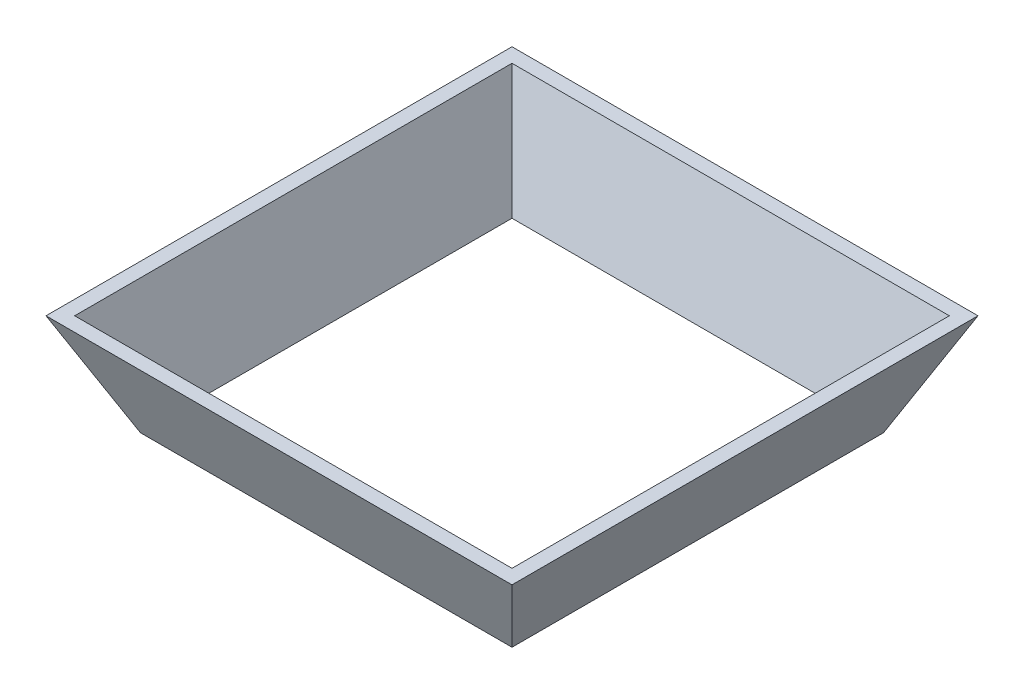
from build123d import *

# Parameters (mm, degrees)
SKETCH1_W           = 55
SKETCH1_H           = 55
BOSS_EXTRUDE1_DEPTH = 15
BOSS_EXTRUDE1_DRAFT = -25
SKETCH3_W           = 55
SKETCH3_H           = 55
CUT_EXTRUDE3_DEPTH  = 15
CUT_EXTRUDE3_DRAFT  = 18


with BuildPart() as part:
    # Sketch1 → Boss-Extrude1 (with draft: the straight prism first)
    with BuildSketch(Plane(origin=(0, 0, 0), x_dir=(1, 0, 0), z_dir=(0, 1, 0))):
        Rectangle(SKETCH1_W, SKETCH1_H)
    extrude(amount=BOSS_EXTRUDE1_DEPTH)
    # Boss-Extrude1: the draft: its side faces are tilted about the plane it starts from
    boss_extrude1_sides = [part.faces().sort_by_distance(p)[0] for p in [
        (0, 7.5, 27.5),
        (27.5, 7.5, 0),
        (0, 7.5, -27.5),
        (-27.5, 7.5, 0),
    ]]
    draft(boss_extrude1_sides, Plane(origin=(0, 0, 0), x_dir=(1, 0, 0), z_dir=(0, 1, 0)), BOSS_EXTRUDE1_DRAFT)


with BuildPart() as cut_extrude3_tool:
    # Sketch3 → Cut-Extrude3 (with draft: the straight prism first)
    with BuildSketch(Plane.XZ):
        Rectangle(SKETCH3_W, SKETCH3_H)
    extrude(amount=-CUT_EXTRUDE3_DEPTH)
    # Cut-Extrude3: the draft: its side faces are tilted about the plane it starts from
    cut_extrude3_sides = [cut_extrude3_tool.faces().sort_by_distance(p)[0] for p in [
        (0, 7.5, -27.5),
        (27.5, 7.5, 0),
        (0, 7.5, 27.5),
        (-27.5, 7.5, 0),
    ]]
    draft(cut_extrude3_sides, Plane.XZ, CUT_EXTRUDE3_DRAFT)


with BuildPart() as part_1:
    add(part.part)

    # Cut-Extrude3: cut by cut_extrude3_tool
    add(cut_extrude3_tool.part, mode=Mode.SUBTRACT)


solid = part_1.part
